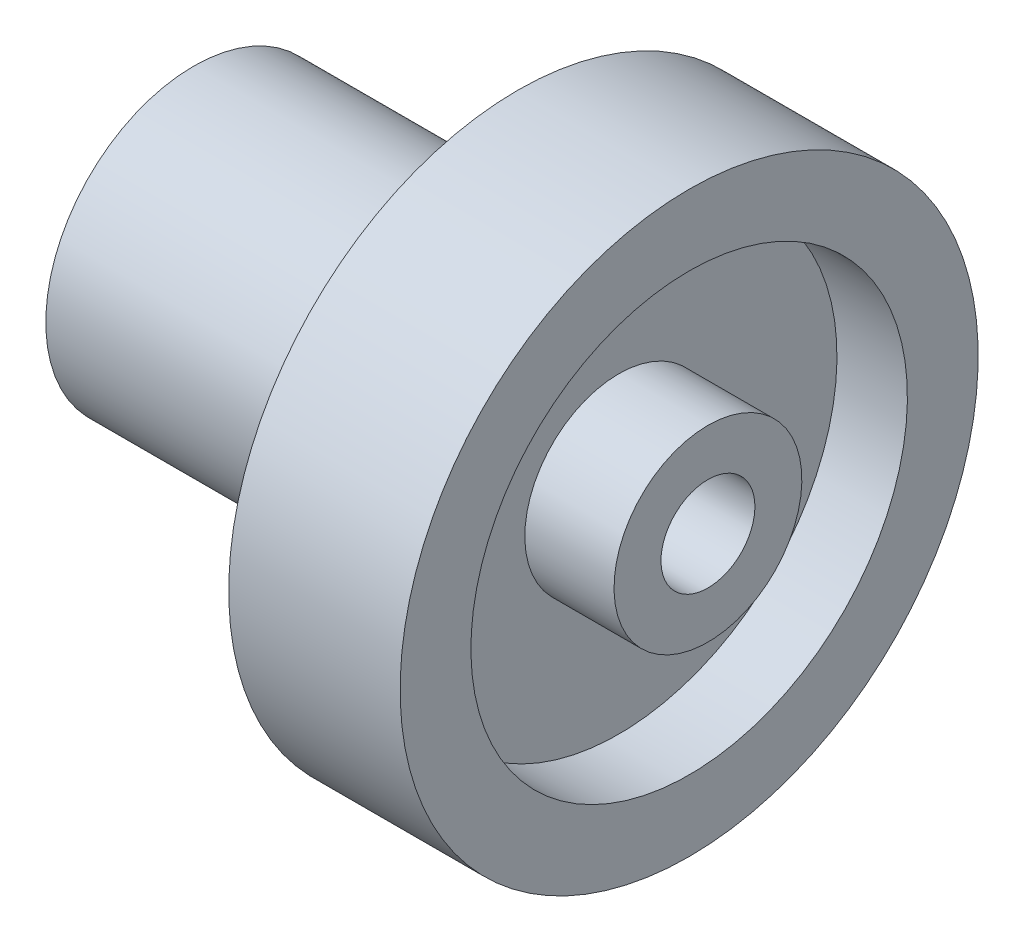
from build123d import *


with BuildPart() as part:
    # Esquisse1 → Base-R_volution (revolve)
    with BuildSketch(Plane.XY):
        Polygon((24.228220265, 16.684309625), (1.328220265, 16.684309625), (1.328220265, 18.816309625), (2.328220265, 19.084309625), (2.328220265, 20.984309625), (18.428220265, 20.984309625), (18.428220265, 23.494309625), (16.128220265, 24.294309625), (16.128220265, 26.994309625), (23.428220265, 26.994309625), (23.428220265, 23.979809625), (20.428220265, 23.979809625), (20.428220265, 18.684309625), (24.228220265, 18.684309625), align=None)
    revolve(axis=Axis((52.66677368, 14.684309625, 0), (-1, 0, 0)))


solid = part.part
